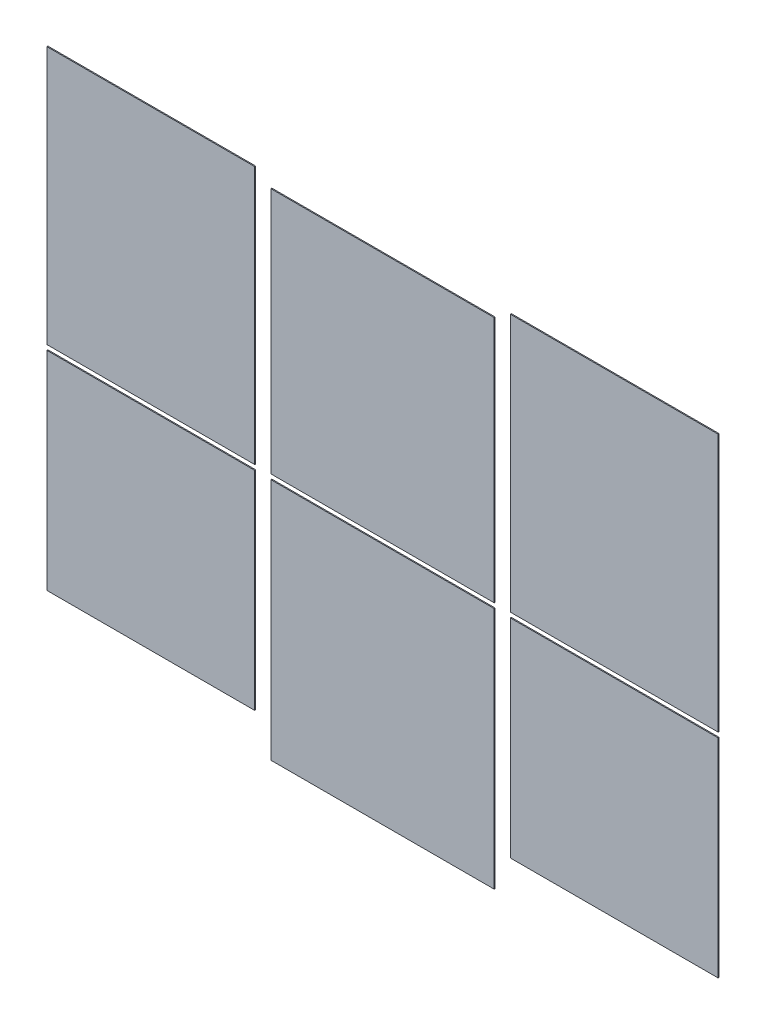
ISO-10303-21;
HEADER;
FILE_DESCRIPTION(('STEP AP214'),'2;1');
FILE_NAME('part.step','',(''),(''),'','','');
FILE_SCHEMA(('AUTOMOTIVE_DESIGN { 1 0 10303 214 1 1 1 1 }'));
ENDSEC;
DATA;
#1=APPLICATION_CONTEXT('core data for automotive mechanical design processes');
#2=APPLICATION_PROTOCOL_DEFINITION('international standard','automotive_design',2000,#1);
#3=PRODUCT_CONTEXT('',#1,'mechanical');
#4=PRODUCT('Part','Part','',(#3));
#5=PRODUCT_RELATED_PRODUCT_CATEGORY('part','',(#4));
#6=PRODUCT_DEFINITION_FORMATION('','',#4);
#7=PRODUCT_DEFINITION_CONTEXT('part definition',#1,'design');
#8=PRODUCT_DEFINITION('design','',#6,#7);
#9=PRODUCT_DEFINITION_SHAPE('','',#8);
#10=(LENGTH_UNIT() NAMED_UNIT(*) SI_UNIT(.MILLI.,.METRE.));
#11=(NAMED_UNIT(*) PLANE_ANGLE_UNIT() SI_UNIT($,.RADIAN.));
#12=(NAMED_UNIT(*) SI_UNIT($,.STERADIAN.) SOLID_ANGLE_UNIT());
#13=UNCERTAINTY_MEASURE_WITH_UNIT(LENGTH_MEASURE(1.E-05),#10,'distance_accuracy_value','');
#14=(GEOMETRIC_REPRESENTATION_CONTEXT(3) GLOBAL_UNCERTAINTY_ASSIGNED_CONTEXT((#13)) GLOBAL_UNIT_ASSIGNED_CONTEXT((#10,
#11,#12)) REPRESENTATION_CONTEXT('',''));
#15=CARTESIAN_POINT('',(0.,0.,0.));
#16=DIRECTION('',(0.,0.,1.));
#17=DIRECTION('',(1.,0.,0.));
#18=AXIS2_PLACEMENT_3D('',#15,#16,#17);
#19=CARTESIAN_POINT('',(-1347.50336801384,10.4351003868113,0.100000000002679));
#20=DIRECTION('',(1.,0.,0.));
#21=DIRECTION('',(0.,0.,-1.));
#22=AXIS2_PLACEMENT_3D('',#19,#20,#21);
#23=PLANE('',#22);
#24=DIRECTION('',(0.,1.,0.));
#25=VECTOR('',#24,1.);
#26=CARTESIAN_POINT('',(-1347.50336801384,10.4351003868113,4.10000000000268));
#27=LINE('',#26,#25);
#28=CARTESIAN_POINT('',(-1347.50336801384,10.4351003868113,4.10000000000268));
#29=VERTEX_POINT('',#28);
#30=CARTESIAN_POINT('',(-1347.50336801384,1040.43510038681,4.10000000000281));
#31=VERTEX_POINT('',#30);
#32=EDGE_CURVE('E114',#29,#31,#27,.T.);
#33=ORIENTED_EDGE('',*,*,#32,.T.);
#34=DIRECTION('',(0.,0.,1.));
#35=VECTOR('',#34,1.);
#36=CARTESIAN_POINT('',(-1347.50336801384,1040.43510038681,0.10000000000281));
#37=LINE('',#36,#35);
#38=CARTESIAN_POINT('',(-1347.50336801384,1040.43510038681,0.10000000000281));
#39=VERTEX_POINT('',#38);
#40=EDGE_CURVE('E12',#39,#31,#37,.T.);
#41=ORIENTED_EDGE('',*,*,#40,.F.);
#42=DIRECTION('',(0.,1.,0.));
#43=VECTOR('',#42,1.);
#44=CARTESIAN_POINT('',(-1347.50336801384,10.4351003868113,0.100000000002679));
#45=LINE('',#44,#43);
#46=CARTESIAN_POINT('',(-1347.50336801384,10.4351003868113,0.100000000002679));
#47=VERTEX_POINT('',#46);
#48=EDGE_CURVE('E101',#47,#39,#45,.T.);
#49=ORIENTED_EDGE('',*,*,#48,.F.);
#50=DIRECTION('',(0.,0.,1.));
#51=VECTOR('',#50,1.);
#52=CARTESIAN_POINT('',(-1347.50336801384,10.4351003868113,0.100000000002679));
#53=LINE('',#52,#51);
#54=EDGE_CURVE('E108',#47,#29,#53,.T.);
#55=ORIENTED_EDGE('',*,*,#54,.T.);
#56=EDGE_LOOP('',(#33,#41,#49,#55));
#57=FACE_BOUND('',#56,.T.);
#58=ADVANCED_FACE('F49',(#57),#23,.F.);
#59=CARTESIAN_POINT('',(-1347.50336801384,1040.43510038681,0.10000000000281));
#60=DIRECTION('',(0.,-1.,0.));
#61=DIRECTION('',(0.,0.,-1.));
#62=AXIS2_PLACEMENT_3D('',#59,#60,#61);
#63=PLANE('',#62);
#64=DIRECTION('',(1.,0.,0.));
#65=VECTOR('',#64,1.);
#66=CARTESIAN_POINT('',(-1347.50336801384,1040.43510038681,4.10000000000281));
#67=LINE('',#66,#65);
#68=CARTESIAN_POINT('',(-517.503368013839,1040.43510038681,4.10000000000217));
#69=VERTEX_POINT('',#68);
#70=EDGE_CURVE('E104',#31,#69,#67,.T.);
#71=ORIENTED_EDGE('',*,*,#70,.T.);
#72=DIRECTION('',(0.,0.,1.));
#73=VECTOR('',#72,1.);
#74=CARTESIAN_POINT('',(-517.503368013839,1040.43510038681,0.100000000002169));
#75=LINE('',#74,#73);
#76=CARTESIAN_POINT('',(-517.503368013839,1040.43510038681,0.100000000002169));
#77=VERTEX_POINT('',#76);
#78=EDGE_CURVE('E59',#77,#69,#75,.T.);
#79=ORIENTED_EDGE('',*,*,#78,.F.);
#80=DIRECTION('',(1.,0.,0.));
#81=VECTOR('',#80,1.);
#82=CARTESIAN_POINT('',(-1347.50336801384,1040.43510038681,0.10000000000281));
#83=LINE('',#82,#81);
#84=EDGE_CURVE('E96',#39,#77,#83,.T.);
#85=ORIENTED_EDGE('',*,*,#84,.F.);
#86=ORIENTED_EDGE('',*,*,#40,.T.);
#87=EDGE_LOOP('',(#71,#79,#85,#86));
#88=FACE_BOUND('',#87,.T.);
#89=ADVANCED_FACE('F102',(#88),#63,.F.);
#90=CARTESIAN_POINT('',(-517.503368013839,10.4351003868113,0.100000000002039));
#91=DIRECTION('',(-1.,0.,0.));
#92=DIRECTION('',(0.,0.,1.));
#93=AXIS2_PLACEMENT_3D('',#90,#91,#92);
#94=PLANE('',#93);
#95=DIRECTION('',(0.,-1.,0.));
#96=VECTOR('',#95,1.);
#97=CARTESIAN_POINT('',(-517.503368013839,10.4351003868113,4.10000000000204));
#98=LINE('',#97,#96);
#99=CARTESIAN_POINT('',(-517.503368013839,10.4351003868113,4.10000000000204));
#100=VERTEX_POINT('',#99);
#101=EDGE_CURVE('E81',#69,#100,#98,.T.);
#102=ORIENTED_EDGE('',*,*,#101,.T.);
#103=DIRECTION('',(0.,0.,1.));
#104=VECTOR('',#103,1.);
#105=CARTESIAN_POINT('',(-517.503368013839,10.4351003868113,0.100000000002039));
#106=LINE('',#105,#104);
#107=CARTESIAN_POINT('',(-517.503368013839,10.4351003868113,0.100000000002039));
#108=VERTEX_POINT('',#107);
#109=EDGE_CURVE('E106',#108,#100,#106,.T.);
#110=ORIENTED_EDGE('',*,*,#109,.F.);
#111=DIRECTION('',(0.,-1.,0.));
#112=VECTOR('',#111,1.);
#113=CARTESIAN_POINT('',(-517.503368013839,10.4351003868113,0.100000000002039));
#114=LINE('',#113,#112);
#115=EDGE_CURVE('E97',#77,#108,#114,.T.);
#116=ORIENTED_EDGE('',*,*,#115,.F.);
#117=ORIENTED_EDGE('',*,*,#78,.T.);
#118=EDGE_LOOP('',(#102,#110,#116,#117));
#119=FACE_BOUND('',#118,.T.);
#120=ADVANCED_FACE('F110',(#119),#94,.F.);
#121=CARTESIAN_POINT('',(-1347.50336801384,10.4351003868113,0.100000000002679));
#122=DIRECTION('',(0.,1.,0.));
#123=DIRECTION('',(0.,0.,1.));
#124=AXIS2_PLACEMENT_3D('',#121,#122,#123);
#125=PLANE('',#124);
#126=DIRECTION('',(-1.,0.,0.));
#127=VECTOR('',#126,1.);
#128=CARTESIAN_POINT('',(-1347.50336801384,10.4351003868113,4.10000000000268));
#129=LINE('',#128,#127);
#130=EDGE_CURVE('E90',#100,#29,#129,.T.);
#131=ORIENTED_EDGE('',*,*,#130,.T.);
#132=ORIENTED_EDGE('',*,*,#54,.F.);
#133=DIRECTION('',(-1.,0.,0.));
#134=VECTOR('',#133,1.);
#135=CARTESIAN_POINT('',(-1347.50336801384,10.4351003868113,0.100000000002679));
#136=LINE('',#135,#134);
#137=EDGE_CURVE('E68',#108,#47,#136,.T.);
#138=ORIENTED_EDGE('',*,*,#137,.F.);
#139=ORIENTED_EDGE('',*,*,#109,.T.);
#140=EDGE_LOOP('',(#131,#132,#138,#139));
#141=FACE_BOUND('',#140,.T.);
#142=ADVANCED_FACE('F118',(#141),#125,.F.);
#143=CARTESIAN_POINT('',(0.,0.,0.100000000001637));
#144=DIRECTION('',(0.,0.,-1.));
#145=DIRECTION('',(-1.,0.,0.));
#146=AXIS2_PLACEMENT_3D('',#143,#144,#145);
#147=PLANE('',#146);
#148=ORIENTED_EDGE('',*,*,#48,.T.);
#149=ORIENTED_EDGE('',*,*,#84,.T.);
#150=ORIENTED_EDGE('',*,*,#115,.T.);
#151=ORIENTED_EDGE('',*,*,#137,.T.);
#152=EDGE_LOOP('',(#148,#149,#150,#151));
#153=FACE_BOUND('',#152,.T.);
#154=ADVANCED_FACE('F100',(#153),#147,.T.);
#155=CARTESIAN_POINT('',(0.,0.,4.10000000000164));
#156=DIRECTION('',(0.,0.,-1.));
#157=DIRECTION('',(-1.,0.,0.));
#158=AXIS2_PLACEMENT_3D('',#155,#156,#157);
#159=PLANE('',#158);
#160=ORIENTED_EDGE('',*,*,#32,.F.);
#161=ORIENTED_EDGE('',*,*,#130,.F.);
#162=ORIENTED_EDGE('',*,*,#101,.F.);
#163=ORIENTED_EDGE('',*,*,#70,.F.);
#164=EDGE_LOOP('',(#160,#161,#162,#163));
#165=FACE_BOUND('',#164,.T.);
#166=ADVANCED_FACE('F121',(#165),#159,.F.);
#167=CLOSED_SHELL('',(#58,#89,#120,#142,#154,#166));
#168=MANIFOLD_SOLID_BREP('B2',#167);
#169=CARTESIAN_POINT('',(-517.503368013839,-839.564899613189,0.100000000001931));
#170=DIRECTION('',(-1.,0.,0.));
#171=DIRECTION('',(0.,0.,1.));
#172=AXIS2_PLACEMENT_3D('',#169,#170,#171);
#173=PLANE('',#172);
#174=DIRECTION('',(0.,-1.,0.));
#175=VECTOR('',#174,1.);
#176=CARTESIAN_POINT('',(-517.503368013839,-839.564899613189,4.10000000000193));
#177=LINE('',#176,#175);
#178=CARTESIAN_POINT('',(-517.503368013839,-9.56489961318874,4.10000000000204));
#179=VERTEX_POINT('',#178);
#180=CARTESIAN_POINT('',(-517.503368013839,-839.564899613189,4.10000000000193));
#181=VERTEX_POINT('',#180);
#182=EDGE_CURVE('E250',#179,#181,#177,.T.);
#183=ORIENTED_EDGE('',*,*,#182,.T.);
#184=DIRECTION('',(0.,0.,1.));
#185=VECTOR('',#184,1.);
#186=CARTESIAN_POINT('',(-517.503368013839,-839.564899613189,0.100000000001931));
#187=LINE('',#186,#185);
#188=CARTESIAN_POINT('',(-517.503368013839,-839.564899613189,0.100000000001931));
#189=VERTEX_POINT('',#188);
#190=EDGE_CURVE('E48',#189,#181,#187,.T.);
#191=ORIENTED_EDGE('',*,*,#190,.F.);
#192=DIRECTION('',(0.,-1.,0.));
#193=VECTOR('',#192,1.);
#194=CARTESIAN_POINT('',(-517.503368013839,-839.564899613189,0.100000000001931));
#195=LINE('',#194,#193);
#196=CARTESIAN_POINT('',(-517.503368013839,-9.56489961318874,0.100000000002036));
#197=VERTEX_POINT('',#196);
#198=EDGE_CURVE('E234',#197,#189,#195,.T.);
#199=ORIENTED_EDGE('',*,*,#198,.F.);
#200=DIRECTION('',(0.,0.,1.));
#201=VECTOR('',#200,1.);
#202=CARTESIAN_POINT('',(-517.503368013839,-9.56489961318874,0.100000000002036));
#203=LINE('',#202,#201);
#204=EDGE_CURVE('E244',#197,#179,#203,.T.);
#205=ORIENTED_EDGE('',*,*,#204,.T.);
#206=EDGE_LOOP('',(#183,#191,#199,#205));
#207=FACE_BOUND('',#206,.T.);
#208=ADVANCED_FACE('F184',(#207),#173,.F.);
#209=CARTESIAN_POINT('',(-517.503368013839,-839.564899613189,0.100000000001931));
#210=DIRECTION('',(0.,1.,0.));
#211=DIRECTION('',(0.,0.,1.));
#212=AXIS2_PLACEMENT_3D('',#209,#210,#211);
#213=PLANE('',#212);
#214=DIRECTION('',(-1.,0.,0.));
#215=VECTOR('',#214,1.);
#216=CARTESIAN_POINT('',(-517.503368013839,-839.564899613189,4.10000000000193));
#217=LINE('',#216,#215);
#218=CARTESIAN_POINT('',(-1347.50336801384,-839.564899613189,4.10000000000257));
#219=VERTEX_POINT('',#218);
#220=EDGE_CURVE('E239',#181,#219,#217,.T.);
#221=ORIENTED_EDGE('',*,*,#220,.T.);
#222=DIRECTION('',(0.,0.,1.));
#223=VECTOR('',#222,1.);
#224=CARTESIAN_POINT('',(-1347.50336801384,-839.564899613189,0.100000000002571));
#225=LINE('',#224,#223);
#226=CARTESIAN_POINT('',(-1347.50336801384,-839.564899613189,0.100000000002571));
#227=VERTEX_POINT('',#226);
#228=EDGE_CURVE('E195',#227,#219,#225,.T.);
#229=ORIENTED_EDGE('',*,*,#228,.F.);
#230=DIRECTION('',(-1.,0.,0.));
#231=VECTOR('',#230,1.);
#232=CARTESIAN_POINT('',(-517.503368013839,-839.564899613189,0.100000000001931));
#233=LINE('',#232,#231);
#234=EDGE_CURVE('E228',#189,#227,#233,.T.);
#235=ORIENTED_EDGE('',*,*,#234,.F.);
#236=ORIENTED_EDGE('',*,*,#190,.T.);
#237=EDGE_LOOP('',(#221,#229,#235,#236));
#238=FACE_BOUND('',#237,.T.);
#239=ADVANCED_FACE('F236',(#238),#213,.F.);
#240=CARTESIAN_POINT('',(-1347.50336801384,-839.564899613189,0.100000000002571));
#241=DIRECTION('',(1.,0.,0.));
#242=DIRECTION('',(0.,0.,-1.));
#243=AXIS2_PLACEMENT_3D('',#240,#241,#242);
#244=PLANE('',#243);
#245=DIRECTION('',(0.,1.,0.));
#246=VECTOR('',#245,1.);
#247=CARTESIAN_POINT('',(-1347.50336801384,-839.564899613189,4.10000000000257));
#248=LINE('',#247,#246);
#249=CARTESIAN_POINT('',(-1347.50336801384,-9.56489961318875,4.10000000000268));
#250=VERTEX_POINT('',#249);
#251=EDGE_CURVE('E220',#219,#250,#248,.T.);
#252=ORIENTED_EDGE('',*,*,#251,.T.);
#253=DIRECTION('',(0.,0.,1.));
#254=VECTOR('',#253,1.);
#255=CARTESIAN_POINT('',(-1347.50336801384,-9.56489961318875,0.100000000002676));
#256=LINE('',#255,#254);
#257=CARTESIAN_POINT('',(-1347.50336801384,-9.56489961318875,0.100000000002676));
#258=VERTEX_POINT('',#257);
#259=EDGE_CURVE('E238',#258,#250,#256,.T.);
#260=ORIENTED_EDGE('',*,*,#259,.F.);
#261=DIRECTION('',(0.,1.,0.));
#262=VECTOR('',#261,1.);
#263=CARTESIAN_POINT('',(-1347.50336801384,-839.564899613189,0.100000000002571));
#264=LINE('',#263,#262);
#265=EDGE_CURVE('E231',#227,#258,#264,.T.);
#266=ORIENTED_EDGE('',*,*,#265,.F.);
#267=ORIENTED_EDGE('',*,*,#228,.T.);
#268=EDGE_LOOP('',(#252,#260,#266,#267));
#269=FACE_BOUND('',#268,.T.);
#270=ADVANCED_FACE('F242',(#269),#244,.F.);
#271=CARTESIAN_POINT('',(-517.503368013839,-9.56489961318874,0.100000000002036));
#272=DIRECTION('',(0.,-1.,0.));
#273=DIRECTION('',(0.,0.,-1.));
#274=AXIS2_PLACEMENT_3D('',#271,#272,#273);
#275=PLANE('',#274);
#276=DIRECTION('',(1.,0.,0.));
#277=VECTOR('',#276,1.);
#278=CARTESIAN_POINT('',(-517.503368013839,-9.56489961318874,4.10000000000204));
#279=LINE('',#278,#277);
#280=EDGE_CURVE('E224',#250,#179,#279,.T.);
#281=ORIENTED_EDGE('',*,*,#280,.T.);
#282=ORIENTED_EDGE('',*,*,#204,.F.);
#283=DIRECTION('',(1.,0.,0.));
#284=VECTOR('',#283,1.);
#285=CARTESIAN_POINT('',(-517.503368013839,-9.56489961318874,0.100000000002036));
#286=LINE('',#285,#284);
#287=EDGE_CURVE('E199',#258,#197,#286,.T.);
#288=ORIENTED_EDGE('',*,*,#287,.F.);
#289=ORIENTED_EDGE('',*,*,#259,.T.);
#290=EDGE_LOOP('',(#281,#282,#288,#289));
#291=FACE_BOUND('',#290,.T.);
#292=ADVANCED_FACE('F255',(#291),#275,.F.);
#293=CARTESIAN_POINT('',(0.,0.,0.100000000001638));
#294=DIRECTION('',(0.,0.,1.));
#295=DIRECTION('',(1.,0.,0.));
#296=AXIS2_PLACEMENT_3D('',#293,#294,#295);
#297=PLANE('',#296);
#298=ORIENTED_EDGE('',*,*,#198,.T.);
#299=ORIENTED_EDGE('',*,*,#234,.T.);
#300=ORIENTED_EDGE('',*,*,#265,.T.);
#301=ORIENTED_EDGE('',*,*,#287,.T.);
#302=EDGE_LOOP('',(#298,#299,#300,#301));
#303=FACE_BOUND('',#302,.T.);
#304=ADVANCED_FACE('F233',(#303),#297,.F.);
#305=CARTESIAN_POINT('',(0.,0.,4.10000000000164));
#306=DIRECTION('',(0.,0.,1.));
#307=DIRECTION('',(1.,0.,0.));
#308=AXIS2_PLACEMENT_3D('',#305,#306,#307);
#309=PLANE('',#308);
#310=ORIENTED_EDGE('',*,*,#182,.F.);
#311=ORIENTED_EDGE('',*,*,#280,.F.);
#312=ORIENTED_EDGE('',*,*,#251,.F.);
#313=ORIENTED_EDGE('',*,*,#220,.F.);
#314=EDGE_LOOP('',(#310,#311,#312,#313));
#315=FACE_BOUND('',#314,.T.);
#316=ADVANCED_FACE('F260',(#315),#309,.T.);
#317=CLOSED_SHELL('',(#208,#239,#270,#292,#304,#316));
#318=MANIFOLD_SOLID_BREP('B6',#317);
#319=CARTESIAN_POINT('',(-453.503368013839,10.4351003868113,0.100000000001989));
#320=DIRECTION('',(1.,0.,0.));
#321=DIRECTION('',(0.,0.,-1.));
#322=AXIS2_PLACEMENT_3D('',#319,#320,#321);
#323=PLANE('',#322);
#324=DIRECTION('',(0.,1.,0.));
#325=VECTOR('',#324,1.);
#326=CARTESIAN_POINT('',(-453.503368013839,10.4351003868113,4.10000000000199));
#327=LINE('',#326,#325);
#328=CARTESIAN_POINT('',(-453.503368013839,10.4351003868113,4.10000000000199));
#329=VERTEX_POINT('',#328);
#330=CARTESIAN_POINT('',(-453.503368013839,996.435100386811,4.10000000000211));
#331=VERTEX_POINT('',#330);
#332=EDGE_CURVE('E381',#329,#331,#327,.T.);
#333=ORIENTED_EDGE('',*,*,#332,.T.);
#334=DIRECTION('',(0.,0.,1.));
#335=VECTOR('',#334,1.);
#336=CARTESIAN_POINT('',(-453.503368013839,996.435100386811,0.100000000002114));
#337=LINE('',#336,#335);
#338=CARTESIAN_POINT('',(-453.503368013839,996.435100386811,0.100000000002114));
#339=VERTEX_POINT('',#338);
#340=EDGE_CURVE('E185',#339,#331,#337,.T.);
#341=ORIENTED_EDGE('',*,*,#340,.F.);
#342=DIRECTION('',(0.,1.,0.));
#343=VECTOR('',#342,1.);
#344=CARTESIAN_POINT('',(-453.503368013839,10.4351003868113,0.100000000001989));
#345=LINE('',#344,#343);
#346=CARTESIAN_POINT('',(-453.503368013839,10.4351003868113,0.100000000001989));
#347=VERTEX_POINT('',#346);
#348=EDGE_CURVE('E369',#347,#339,#345,.T.);
#349=ORIENTED_EDGE('',*,*,#348,.F.);
#350=DIRECTION('',(0.,0.,1.));
#351=VECTOR('',#350,1.);
#352=CARTESIAN_POINT('',(-453.503368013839,10.4351003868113,0.100000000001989));
#353=LINE('',#352,#351);
#354=EDGE_CURVE('E380',#347,#329,#353,.T.);
#355=ORIENTED_EDGE('',*,*,#354,.T.);
#356=EDGE_LOOP('',(#333,#341,#349,#355));
#357=FACE_BOUND('',#356,.T.);
#358=ADVANCED_FACE('F318',(#357),#323,.F.);
#359=CARTESIAN_POINT('',(-453.503368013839,996.435100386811,0.100000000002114));
#360=DIRECTION('',(0.,-1.,0.));
#361=DIRECTION('',(0.,0.,-1.));
#362=AXIS2_PLACEMENT_3D('',#359,#360,#361);
#363=PLANE('',#362);
#364=DIRECTION('',(1.,0.,0.));
#365=VECTOR('',#364,1.);
#366=CARTESIAN_POINT('',(-453.503368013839,996.435100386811,4.10000000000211));
#367=LINE('',#366,#365);
#368=CARTESIAN_POINT('',(438.496631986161,996.435100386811,4.10000000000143));
#369=VERTEX_POINT('',#368);
#370=EDGE_CURVE('E373',#331,#369,#367,.T.);
#371=ORIENTED_EDGE('',*,*,#370,.T.);
#372=DIRECTION('',(0.,0.,1.));
#373=VECTOR('',#372,1.);
#374=CARTESIAN_POINT('',(438.496631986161,996.435100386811,0.100000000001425));
#375=LINE('',#374,#373);
#376=CARTESIAN_POINT('',(438.496631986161,996.435100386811,0.100000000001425));
#377=VERTEX_POINT('',#376);
#378=EDGE_CURVE('E326',#377,#369,#375,.T.);
#379=ORIENTED_EDGE('',*,*,#378,.F.);
#380=DIRECTION('',(1.,0.,0.));
#381=VECTOR('',#380,1.);
#382=CARTESIAN_POINT('',(-453.503368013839,996.435100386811,0.100000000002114));
#383=LINE('',#382,#381);
#384=EDGE_CURVE('E365',#339,#377,#383,.T.);
#385=ORIENTED_EDGE('',*,*,#384,.F.);
#386=ORIENTED_EDGE('',*,*,#340,.T.);
#387=EDGE_LOOP('',(#371,#379,#385,#386));
#388=FACE_BOUND('',#387,.T.);
#389=ADVANCED_FACE('F375',(#388),#363,.F.);
#390=CARTESIAN_POINT('',(438.496631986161,10.4351003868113,0.1000000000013));
#391=DIRECTION('',(-1.,0.,0.));
#392=DIRECTION('',(0.,0.,1.));
#393=AXIS2_PLACEMENT_3D('',#390,#391,#392);
#394=PLANE('',#393);
#395=DIRECTION('',(0.,-1.,0.));
#396=VECTOR('',#395,1.);
#397=CARTESIAN_POINT('',(438.496631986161,10.4351003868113,4.1000000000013));
#398=LINE('',#397,#396);
#399=CARTESIAN_POINT('',(438.496631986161,10.4351003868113,4.1000000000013));
#400=VERTEX_POINT('',#399);
#401=EDGE_CURVE('E352',#369,#400,#398,.T.);
#402=ORIENTED_EDGE('',*,*,#401,.T.);
#403=DIRECTION('',(0.,0.,1.));
#404=VECTOR('',#403,1.);
#405=CARTESIAN_POINT('',(438.496631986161,10.4351003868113,0.1000000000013));
#406=LINE('',#405,#404);
#407=CARTESIAN_POINT('',(438.496631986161,10.4351003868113,0.1000000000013));
#408=VERTEX_POINT('',#407);
#409=EDGE_CURVE('E372',#408,#400,#406,.T.);
#410=ORIENTED_EDGE('',*,*,#409,.F.);
#411=DIRECTION('',(0.,-1.,0.));
#412=VECTOR('',#411,1.);
#413=CARTESIAN_POINT('',(438.496631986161,10.4351003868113,0.1000000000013));
#414=LINE('',#413,#412);
#415=EDGE_CURVE('E370',#377,#408,#414,.T.);
#416=ORIENTED_EDGE('',*,*,#415,.F.);
#417=ORIENTED_EDGE('',*,*,#378,.T.);
#418=EDGE_LOOP('',(#402,#410,#416,#417));
#419=FACE_BOUND('',#418,.T.);
#420=ADVANCED_FACE('F374',(#419),#394,.F.);
#421=CARTESIAN_POINT('',(-453.503368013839,10.4351003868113,0.100000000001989));
#422=DIRECTION('',(0.,1.,0.));
#423=DIRECTION('',(0.,0.,1.));
#424=AXIS2_PLACEMENT_3D('',#421,#422,#423);
#425=PLANE('',#424);
#426=DIRECTION('',(-1.,0.,0.));
#427=VECTOR('',#426,1.);
#428=CARTESIAN_POINT('',(-453.503368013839,10.4351003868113,4.10000000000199));
#429=LINE('',#428,#427);
#430=EDGE_CURVE('E360',#400,#329,#429,.T.);
#431=ORIENTED_EDGE('',*,*,#430,.T.);
#432=ORIENTED_EDGE('',*,*,#354,.F.);
#433=DIRECTION('',(-1.,0.,0.));
#434=VECTOR('',#433,1.);
#435=CARTESIAN_POINT('',(-453.503368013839,10.4351003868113,0.100000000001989));
#436=LINE('',#435,#434);
#437=EDGE_CURVE('E331',#408,#347,#436,.T.);
#438=ORIENTED_EDGE('',*,*,#437,.F.);
#439=ORIENTED_EDGE('',*,*,#409,.T.);
#440=EDGE_LOOP('',(#431,#432,#438,#439));
#441=FACE_BOUND('',#440,.T.);
#442=ADVANCED_FACE('F389',(#441),#425,.F.);
#443=CARTESIAN_POINT('',(0.,0.,0.100000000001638));
#444=DIRECTION('',(0.,0.,-1.));
#445=DIRECTION('',(-1.,0.,0.));
#446=AXIS2_PLACEMENT_3D('',#443,#444,#445);
#447=PLANE('',#446);
#448=ORIENTED_EDGE('',*,*,#348,.T.);
#449=ORIENTED_EDGE('',*,*,#384,.T.);
#450=ORIENTED_EDGE('',*,*,#415,.T.);
#451=ORIENTED_EDGE('',*,*,#437,.T.);
#452=EDGE_LOOP('',(#448,#449,#450,#451));
#453=FACE_BOUND('',#452,.T.);
#454=ADVANCED_FACE('F364',(#453),#447,.T.);
#455=CARTESIAN_POINT('',(0.,0.,4.10000000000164));
#456=DIRECTION('',(0.,0.,-1.));
#457=DIRECTION('',(-1.,0.,0.));
#458=AXIS2_PLACEMENT_3D('',#455,#456,#457);
#459=PLANE('',#458);
#460=ORIENTED_EDGE('',*,*,#332,.F.);
#461=ORIENTED_EDGE('',*,*,#430,.F.);
#462=ORIENTED_EDGE('',*,*,#401,.F.);
#463=ORIENTED_EDGE('',*,*,#370,.F.);
#464=EDGE_LOOP('',(#460,#461,#462,#463));
#465=FACE_BOUND('',#464,.T.);
#466=ADVANCED_FACE('F392',(#465),#459,.F.);
#467=CLOSED_SHELL('',(#358,#389,#420,#442,#454,#466));
#468=MANIFOLD_SOLID_BREP('B45',#467);
#469=CARTESIAN_POINT('',(438.496631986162,-979.564899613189,0.100000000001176));
#470=DIRECTION('',(-1.,0.,0.));
#471=DIRECTION('',(0.,0.,1.));
#472=AXIS2_PLACEMENT_3D('',#469,#470,#471);
#473=PLANE('',#472);
#474=DIRECTION('',(0.,-1.,0.));
#475=VECTOR('',#474,1.);
#476=CARTESIAN_POINT('',(438.496631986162,-979.564899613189,4.10000000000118));
#477=LINE('',#476,#475);
#478=CARTESIAN_POINT('',(438.496631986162,-9.56489961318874,4.1000000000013));
#479=VERTEX_POINT('',#478);
#480=CARTESIAN_POINT('',(438.496631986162,-979.564899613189,4.10000000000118));
#481=VERTEX_POINT('',#480);
#482=EDGE_CURVE('E513',#479,#481,#477,.T.);
#483=ORIENTED_EDGE('',*,*,#482,.T.);
#484=DIRECTION('',(0.,0.,1.));
#485=VECTOR('',#484,1.);
#486=CARTESIAN_POINT('',(438.496631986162,-979.564899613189,0.100000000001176));
#487=LINE('',#486,#485);
#488=CARTESIAN_POINT('',(438.496631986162,-979.564899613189,0.100000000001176));
#489=VERTEX_POINT('',#488);
#490=EDGE_CURVE('E316',#489,#481,#487,.T.);
#491=ORIENTED_EDGE('',*,*,#490,.F.);
#492=DIRECTION('',(0.,-1.,0.));
#493=VECTOR('',#492,1.);
#494=CARTESIAN_POINT('',(438.496631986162,-979.564899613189,0.100000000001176));
#495=LINE('',#494,#493);
#496=CARTESIAN_POINT('',(438.496631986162,-9.56489961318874,0.100000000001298));
#497=VERTEX_POINT('',#496);
#498=EDGE_CURVE('E504',#497,#489,#495,.T.);
#499=ORIENTED_EDGE('',*,*,#498,.F.);
#500=DIRECTION('',(0.,0.,1.));
#501=VECTOR('',#500,1.);
#502=CARTESIAN_POINT('',(438.496631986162,-9.56489961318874,0.100000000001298));
#503=LINE('',#502,#501);
#504=EDGE_CURVE('E512',#497,#479,#503,.T.);
#505=ORIENTED_EDGE('',*,*,#504,.T.);
#506=EDGE_LOOP('',(#483,#491,#499,#505));
#507=FACE_BOUND('',#506,.T.);
#508=ADVANCED_FACE('F455',(#507),#473,.F.);
#509=CARTESIAN_POINT('',(438.496631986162,-979.564899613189,0.100000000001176));
#510=DIRECTION('',(0.,1.,0.));
#511=DIRECTION('',(0.,0.,1.));
#512=AXIS2_PLACEMENT_3D('',#509,#510,#511);
#513=PLANE('',#512);
#514=DIRECTION('',(-1.,0.,0.));
#515=VECTOR('',#514,1.);
#516=CARTESIAN_POINT('',(438.496631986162,-979.564899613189,4.10000000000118));
#517=LINE('',#516,#515);
#518=CARTESIAN_POINT('',(-453.503368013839,-979.564899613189,4.10000000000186));
#519=VERTEX_POINT('',#518);
#520=EDGE_CURVE('E510',#481,#519,#517,.T.);
#521=ORIENTED_EDGE('',*,*,#520,.T.);
#522=DIRECTION('',(0.,0.,1.));
#523=VECTOR('',#522,1.);
#524=CARTESIAN_POINT('',(-453.503368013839,-979.564899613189,0.100000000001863));
#525=LINE('',#524,#523);
#526=CARTESIAN_POINT('',(-453.503368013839,-979.564899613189,0.100000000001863));
#527=VERTEX_POINT('',#526);
#528=EDGE_CURVE('E458',#527,#519,#525,.T.);
#529=ORIENTED_EDGE('',*,*,#528,.F.);
#530=DIRECTION('',(-1.,0.,0.));
#531=VECTOR('',#530,1.);
#532=CARTESIAN_POINT('',(438.496631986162,-979.564899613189,0.100000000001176));
#533=LINE('',#532,#531);
#534=EDGE_CURVE('E499',#489,#527,#533,.T.);
#535=ORIENTED_EDGE('',*,*,#534,.F.);
#536=ORIENTED_EDGE('',*,*,#490,.T.);
#537=EDGE_LOOP('',(#521,#529,#535,#536));
#538=FACE_BOUND('',#537,.T.);
#539=ADVANCED_FACE('F508',(#538),#513,.F.);
#540=CARTESIAN_POINT('',(-453.503368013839,-979.564899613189,0.100000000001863));
#541=DIRECTION('',(1.,0.,0.));
#542=DIRECTION('',(0.,0.,-1.));
#543=AXIS2_PLACEMENT_3D('',#540,#541,#542);
#544=PLANE('',#543);
#545=DIRECTION('',(0.,1.,0.));
#546=VECTOR('',#545,1.);
#547=CARTESIAN_POINT('',(-453.503368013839,-979.564899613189,4.10000000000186));
#548=LINE('',#547,#546);
#549=CARTESIAN_POINT('',(-453.503368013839,-9.56489961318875,4.10000000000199));
#550=VERTEX_POINT('',#549);
#551=EDGE_CURVE('E484',#519,#550,#548,.T.);
#552=ORIENTED_EDGE('',*,*,#551,.T.);
#553=DIRECTION('',(0.,0.,1.));
#554=VECTOR('',#553,1.);
#555=CARTESIAN_POINT('',(-453.503368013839,-9.56489961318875,0.100000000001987));
#556=LINE('',#555,#554);
#557=CARTESIAN_POINT('',(-453.503368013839,-9.56489961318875,0.100000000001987));
#558=VERTEX_POINT('',#557);
#559=EDGE_CURVE('E506',#558,#550,#556,.T.);
#560=ORIENTED_EDGE('',*,*,#559,.F.);
#561=DIRECTION('',(0.,1.,0.));
#562=VECTOR('',#561,1.);
#563=CARTESIAN_POINT('',(-453.503368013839,-979.564899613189,0.100000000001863));
#564=LINE('',#563,#562);
#565=EDGE_CURVE('E502',#527,#558,#564,.T.);
#566=ORIENTED_EDGE('',*,*,#565,.F.);
#567=ORIENTED_EDGE('',*,*,#528,.T.);
#568=EDGE_LOOP('',(#552,#560,#566,#567));
#569=FACE_BOUND('',#568,.T.);
#570=ADVANCED_FACE('F507',(#569),#544,.F.);
#571=CARTESIAN_POINT('',(438.496631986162,-9.56489961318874,0.100000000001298));
#572=DIRECTION('',(0.,-1.,0.));
#573=DIRECTION('',(0.,0.,-1.));
#574=AXIS2_PLACEMENT_3D('',#571,#572,#573);
#575=PLANE('',#574);
#576=DIRECTION('',(1.,0.,0.));
#577=VECTOR('',#576,1.);
#578=CARTESIAN_POINT('',(438.496631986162,-9.56489961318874,4.1000000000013));
#579=LINE('',#578,#577);
#580=EDGE_CURVE('E491',#550,#479,#579,.T.);
#581=ORIENTED_EDGE('',*,*,#580,.T.);
#582=ORIENTED_EDGE('',*,*,#504,.F.);
#583=DIRECTION('',(1.,0.,0.));
#584=VECTOR('',#583,1.);
#585=CARTESIAN_POINT('',(438.496631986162,-9.56489961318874,0.100000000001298));
#586=LINE('',#585,#584);
#587=EDGE_CURVE('E466',#558,#497,#586,.T.);
#588=ORIENTED_EDGE('',*,*,#587,.F.);
#589=ORIENTED_EDGE('',*,*,#559,.T.);
#590=EDGE_LOOP('',(#581,#582,#588,#589));
#591=FACE_BOUND('',#590,.T.);
#592=ADVANCED_FACE('F525',(#591),#575,.F.);
#593=CARTESIAN_POINT('',(0.,0.,0.100000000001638));
#594=DIRECTION('',(0.,0.,1.));
#595=DIRECTION('',(1.,0.,0.));
#596=AXIS2_PLACEMENT_3D('',#593,#594,#595);
#597=PLANE('',#596);
#598=ORIENTED_EDGE('',*,*,#498,.T.);
#599=ORIENTED_EDGE('',*,*,#534,.T.);
#600=ORIENTED_EDGE('',*,*,#565,.T.);
#601=ORIENTED_EDGE('',*,*,#587,.T.);
#602=EDGE_LOOP('',(#598,#599,#600,#601));
#603=FACE_BOUND('',#602,.T.);
#604=ADVANCED_FACE('F496',(#603),#597,.F.);
#605=CARTESIAN_POINT('',(0.,0.,4.10000000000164));
#606=DIRECTION('',(0.,0.,1.));
#607=DIRECTION('',(1.,0.,0.));
#608=AXIS2_PLACEMENT_3D('',#605,#606,#607);
#609=PLANE('',#608);
#610=ORIENTED_EDGE('',*,*,#482,.F.);
#611=ORIENTED_EDGE('',*,*,#580,.F.);
#612=ORIENTED_EDGE('',*,*,#551,.F.);
#613=ORIENTED_EDGE('',*,*,#520,.F.);
#614=EDGE_LOOP('',(#610,#611,#612,#613));
#615=FACE_BOUND('',#614,.T.);
#616=ADVANCED_FACE('F524',(#615),#609,.T.);
#617=CLOSED_SHELL('',(#508,#539,#570,#592,#604,#616));
#618=MANIFOLD_SOLID_BREP('B178',#617);
#619=CARTESIAN_POINT('',(1332.49663198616,-9.56489961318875,0.100000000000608));
#620=DIRECTION('',(-1.,0.,0.));
#621=DIRECTION('',(0.,0.,1.));
#622=AXIS2_PLACEMENT_3D('',#619,#620,#621);
#623=PLANE('',#622);
#624=DIRECTION('',(0.,-1.,0.));
#625=VECTOR('',#624,1.);
#626=CARTESIAN_POINT('',(1332.49663198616,-9.56489961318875,4.10000000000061));
#627=LINE('',#626,#625);
#628=CARTESIAN_POINT('',(1332.49663198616,-9.56489961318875,4.10000000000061));
#629=VERTEX_POINT('',#628);
#630=CARTESIAN_POINT('',(1332.49663198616,-839.564899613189,4.1000000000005));
#631=VERTEX_POINT('',#630);
#632=EDGE_CURVE('E648',#629,#631,#627,.T.);
#633=ORIENTED_EDGE('',*,*,#632,.T.);
#634=DIRECTION('',(0.,0.,1.));
#635=VECTOR('',#634,1.);
#636=CARTESIAN_POINT('',(1332.49663198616,-839.564899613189,0.100000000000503));
#637=LINE('',#636,#635);
#638=CARTESIAN_POINT('',(1332.49663198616,-839.564899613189,0.100000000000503));
#639=VERTEX_POINT('',#638);
#640=EDGE_CURVE('E448',#639,#631,#637,.T.);
#641=ORIENTED_EDGE('',*,*,#640,.F.);
#642=DIRECTION('',(0.,-1.,0.));
#643=VECTOR('',#642,1.);
#644=CARTESIAN_POINT('',(1332.49663198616,-9.56489961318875,0.100000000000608));
#645=LINE('',#644,#643);
#646=CARTESIAN_POINT('',(1332.49663198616,-9.56489961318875,0.100000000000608));
#647=VERTEX_POINT('',#646);
#648=EDGE_CURVE('E638',#647,#639,#645,.T.);
#649=ORIENTED_EDGE('',*,*,#648,.F.);
#650=DIRECTION('',(0.,0.,1.));
#651=VECTOR('',#650,1.);
#652=CARTESIAN_POINT('',(1332.49663198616,-9.56489961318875,0.100000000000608));
#653=LINE('',#652,#651);
#654=EDGE_CURVE('E644',#647,#629,#653,.T.);
#655=ORIENTED_EDGE('',*,*,#654,.T.);
#656=EDGE_LOOP('',(#633,#641,#649,#655));
#657=FACE_BOUND('',#656,.T.);
#658=ADVANCED_FACE('F584',(#657),#623,.F.);
#659=CARTESIAN_POINT('',(1332.49663198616,-839.564899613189,0.100000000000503));
#660=DIRECTION('',(0.,1.,0.));
#661=DIRECTION('',(0.,0.,1.));
#662=AXIS2_PLACEMENT_3D('',#659,#660,#661);
#663=PLANE('',#662);
#664=DIRECTION('',(-1.,0.,0.));
#665=VECTOR('',#664,1.);
#666=CARTESIAN_POINT('',(1332.49663198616,-839.564899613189,4.1000000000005));
#667=LINE('',#666,#665);
#668=CARTESIAN_POINT('',(502.496631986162,-839.564899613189,4.10000000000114));
#669=VERTEX_POINT('',#668);
#670=EDGE_CURVE('E639',#631,#669,#667,.T.);
#671=ORIENTED_EDGE('',*,*,#670,.T.);
#672=DIRECTION('',(0.,0.,1.));
#673=VECTOR('',#672,1.);
#674=CARTESIAN_POINT('',(502.496631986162,-839.564899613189,0.100000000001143));
#675=LINE('',#674,#673);
#676=CARTESIAN_POINT('',(502.496631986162,-839.564899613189,0.100000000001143));
#677=VERTEX_POINT('',#676);
#678=EDGE_CURVE('E593',#677,#669,#675,.T.);
#679=ORIENTED_EDGE('',*,*,#678,.F.);
#680=DIRECTION('',(-1.,0.,0.));
#681=VECTOR('',#680,1.);
#682=CARTESIAN_POINT('',(1332.49663198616,-839.564899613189,0.100000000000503));
#683=LINE('',#682,#681);
#684=EDGE_CURVE('E633',#639,#677,#683,.T.);
#685=ORIENTED_EDGE('',*,*,#684,.F.);
#686=ORIENTED_EDGE('',*,*,#640,.T.);
#687=EDGE_LOOP('',(#671,#679,#685,#686));
#688=FACE_BOUND('',#687,.T.);
#689=ADVANCED_FACE('F640',(#688),#663,.F.);
#690=CARTESIAN_POINT('',(502.496631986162,-9.56489961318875,0.100000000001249));
#691=DIRECTION('',(1.,0.,0.));
#692=DIRECTION('',(0.,0.,-1.));
#693=AXIS2_PLACEMENT_3D('',#690,#691,#692);
#694=PLANE('',#693);
#695=DIRECTION('',(0.,1.,0.));
#696=VECTOR('',#695,1.);
#697=CARTESIAN_POINT('',(502.496631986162,-9.56489961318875,4.10000000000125));
#698=LINE('',#697,#696);
#699=CARTESIAN_POINT('',(502.496631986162,-9.56489961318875,4.10000000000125));
#700=VERTEX_POINT('',#699);
#701=EDGE_CURVE('E616',#669,#700,#698,.T.);
#702=ORIENTED_EDGE('',*,*,#701,.T.);
#703=DIRECTION('',(0.,0.,1.));
#704=VECTOR('',#703,1.);
#705=CARTESIAN_POINT('',(502.496631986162,-9.56489961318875,0.100000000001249));
#706=LINE('',#705,#704);
#707=CARTESIAN_POINT('',(502.496631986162,-9.56489961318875,0.100000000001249));
#708=VERTEX_POINT('',#707);
#709=EDGE_CURVE('E643',#708,#700,#706,.T.);
#710=ORIENTED_EDGE('',*,*,#709,.F.);
#711=DIRECTION('',(0.,1.,0.));
#712=VECTOR('',#711,1.);
#713=CARTESIAN_POINT('',(502.496631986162,-9.56489961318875,0.100000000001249));
#714=LINE('',#713,#712);
#715=EDGE_CURVE('E632',#677,#708,#714,.T.);
#716=ORIENTED_EDGE('',*,*,#715,.F.);
#717=ORIENTED_EDGE('',*,*,#678,.T.);
#718=EDGE_LOOP('',(#702,#710,#716,#717));
#719=FACE_BOUND('',#718,.T.);
#720=ADVANCED_FACE('F645',(#719),#694,.F.);
#721=CARTESIAN_POINT('',(1332.49663198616,-9.56489961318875,0.100000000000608));
#722=DIRECTION('',(0.,-1.,0.));
#723=DIRECTION('',(0.,0.,-1.));
#724=AXIS2_PLACEMENT_3D('',#721,#722,#723);
#725=PLANE('',#724);
#726=DIRECTION('',(1.,0.,0.));
#727=VECTOR('',#726,1.);
#728=CARTESIAN_POINT('',(1332.49663198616,-9.56489961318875,4.10000000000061));
#729=LINE('',#728,#727);
#730=EDGE_CURVE('E624',#700,#629,#729,.T.);
#731=ORIENTED_EDGE('',*,*,#730,.T.);
#732=ORIENTED_EDGE('',*,*,#654,.F.);
#733=DIRECTION('',(1.,0.,0.));
#734=VECTOR('',#733,1.);
#735=CARTESIAN_POINT('',(1332.49663198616,-9.56489961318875,0.100000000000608));
#736=LINE('',#735,#734);
#737=EDGE_CURVE('E601',#708,#647,#736,.T.);
#738=ORIENTED_EDGE('',*,*,#737,.F.);
#739=ORIENTED_EDGE('',*,*,#709,.T.);
#740=EDGE_LOOP('',(#731,#732,#738,#739));
#741=FACE_BOUND('',#740,.T.);
#742=ADVANCED_FACE('F654',(#741),#725,.F.);
#743=CARTESIAN_POINT('',(0.,0.,0.100000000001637));
#744=DIRECTION('',(0.,0.,-1.));
#745=DIRECTION('',(-1.,0.,0.));
#746=AXIS2_PLACEMENT_3D('',#743,#744,#745);
#747=PLANE('',#746);
#748=ORIENTED_EDGE('',*,*,#648,.T.);
#749=ORIENTED_EDGE('',*,*,#684,.T.);
#750=ORIENTED_EDGE('',*,*,#715,.T.);
#751=ORIENTED_EDGE('',*,*,#737,.T.);
#752=EDGE_LOOP('',(#748,#749,#750,#751));
#753=FACE_BOUND('',#752,.T.);
#754=ADVANCED_FACE('F635',(#753),#747,.T.);
#755=CARTESIAN_POINT('',(0.,0.,4.10000000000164));
#756=DIRECTION('',(0.,0.,-1.));
#757=DIRECTION('',(-1.,0.,0.));
#758=AXIS2_PLACEMENT_3D('',#755,#756,#757);
#759=PLANE('',#758);
#760=ORIENTED_EDGE('',*,*,#632,.F.);
#761=ORIENTED_EDGE('',*,*,#730,.F.);
#762=ORIENTED_EDGE('',*,*,#701,.F.);
#763=ORIENTED_EDGE('',*,*,#670,.F.);
#764=EDGE_LOOP('',(#760,#761,#762,#763));
#765=FACE_BOUND('',#764,.T.);
#766=ADVANCED_FACE('F657',(#765),#759,.F.);
#767=CLOSED_SHELL('',(#658,#689,#720,#742,#754,#766));
#768=MANIFOLD_SOLID_BREP('B309',#767);
#769=CARTESIAN_POINT('',(1332.49663198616,1040.43510038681,0.100000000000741));
#770=DIRECTION('',(-1.,0.,0.));
#771=DIRECTION('',(0.,0.,1.));
#772=AXIS2_PLACEMENT_3D('',#769,#770,#771);
#773=PLANE('',#772);
#774=DIRECTION('',(0.,-1.,0.));
#775=VECTOR('',#774,1.);
#776=CARTESIAN_POINT('',(1332.49663198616,1040.43510038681,4.10000000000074));
#777=LINE('',#776,#775);
#778=CARTESIAN_POINT('',(1332.49663198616,1040.43510038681,4.10000000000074));
#779=VERTEX_POINT('',#778);
#780=CARTESIAN_POINT('',(1332.49663198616,10.4351003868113,4.10000000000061));
#781=VERTEX_POINT('',#780);
#782=EDGE_CURVE('E775',#779,#781,#777,.T.);
#783=ORIENTED_EDGE('',*,*,#782,.T.);
#784=DIRECTION('',(0.,0.,1.));
#785=VECTOR('',#784,1.);
#786=CARTESIAN_POINT('',(1332.49663198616,10.4351003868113,0.100000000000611));
#787=LINE('',#786,#785);
#788=CARTESIAN_POINT('',(1332.49663198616,10.4351003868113,0.100000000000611));
#789=VERTEX_POINT('',#788);
#790=EDGE_CURVE('E581',#789,#781,#787,.T.);
#791=ORIENTED_EDGE('',*,*,#790,.F.);
#792=DIRECTION('',(0.,-1.,0.));
#793=VECTOR('',#792,1.);
#794=CARTESIAN_POINT('',(1332.49663198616,1040.43510038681,0.100000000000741));
#795=LINE('',#794,#793);
#796=CARTESIAN_POINT('',(1332.49663198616,1040.43510038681,0.100000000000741));
#797=VERTEX_POINT('',#796);
#798=EDGE_CURVE('E759',#797,#789,#795,.T.);
#799=ORIENTED_EDGE('',*,*,#798,.F.);
#800=DIRECTION('',(0.,0.,1.));
#801=VECTOR('',#800,1.);
#802=CARTESIAN_POINT('',(1332.49663198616,1040.43510038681,0.100000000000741));
#803=LINE('',#802,#801);
#804=EDGE_CURVE('E767',#797,#779,#803,.T.);
#805=ORIENTED_EDGE('',*,*,#804,.T.);
#806=EDGE_LOOP('',(#783,#791,#799,#805));
#807=FACE_BOUND('',#806,.T.);
#808=ADVANCED_FACE('F707',(#807),#773,.F.);
#809=CARTESIAN_POINT('',(1332.49663198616,10.4351003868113,0.100000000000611));
#810=DIRECTION('',(0.,1.,0.));
#811=DIRECTION('',(0.,0.,1.));
#812=AXIS2_PLACEMENT_3D('',#809,#810,#811);
#813=PLANE('',#812);
#814=DIRECTION('',(-1.,0.,0.));
#815=VECTOR('',#814,1.);
#816=CARTESIAN_POINT('',(1332.49663198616,10.4351003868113,4.10000000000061));
#817=LINE('',#816,#815);
#818=CARTESIAN_POINT('',(502.496631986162,10.4351003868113,4.10000000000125));
#819=VERTEX_POINT('',#818);
#820=EDGE_CURVE('E762',#781,#819,#817,.T.);
#821=ORIENTED_EDGE('',*,*,#820,.T.);
#822=DIRECTION('',(0.,0.,1.));
#823=VECTOR('',#822,1.);
#824=CARTESIAN_POINT('',(502.496631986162,10.4351003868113,0.100000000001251));
#825=LINE('',#824,#823);
#826=CARTESIAN_POINT('',(502.496631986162,10.4351003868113,0.100000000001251));
#827=VERTEX_POINT('',#826);
#828=EDGE_CURVE('E720',#827,#819,#825,.T.);
#829=ORIENTED_EDGE('',*,*,#828,.F.);
#830=DIRECTION('',(-1.,0.,0.));
#831=VECTOR('',#830,1.);
#832=CARTESIAN_POINT('',(1332.49663198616,10.4351003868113,0.100000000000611));
#833=LINE('',#832,#831);
#834=EDGE_CURVE('E752',#789,#827,#833,.T.);
#835=ORIENTED_EDGE('',*,*,#834,.F.);
#836=ORIENTED_EDGE('',*,*,#790,.T.);
#837=EDGE_LOOP('',(#821,#829,#835,#836));
#838=FACE_BOUND('',#837,.T.);
#839=ADVANCED_FACE('F763',(#838),#813,.F.);
#840=CARTESIAN_POINT('',(502.496631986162,1040.43510038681,0.100000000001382));
#841=DIRECTION('',(1.,0.,0.));
#842=DIRECTION('',(0.,0.,-1.));
#843=AXIS2_PLACEMENT_3D('',#840,#841,#842);
#844=PLANE('',#843);
#845=DIRECTION('',(0.,1.,0.));
#846=VECTOR('',#845,1.);
#847=CARTESIAN_POINT('',(502.496631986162,1040.43510038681,4.10000000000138));
#848=LINE('',#847,#846);
#849=CARTESIAN_POINT('',(502.496631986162,1040.43510038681,4.10000000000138));
#850=VERTEX_POINT('',#849);
#851=EDGE_CURVE('E745',#819,#850,#848,.T.);
#852=ORIENTED_EDGE('',*,*,#851,.T.);
#853=DIRECTION('',(0.,0.,1.));
#854=VECTOR('',#853,1.);
#855=CARTESIAN_POINT('',(502.496631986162,1040.43510038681,0.100000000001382));
#856=LINE('',#855,#854);
#857=CARTESIAN_POINT('',(502.496631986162,1040.43510038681,0.100000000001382));
#858=VERTEX_POINT('',#857);
#859=EDGE_CURVE('E764',#858,#850,#856,.T.);
#860=ORIENTED_EDGE('',*,*,#859,.F.);
#861=DIRECTION('',(0.,1.,0.));
#862=VECTOR('',#861,1.);
#863=CARTESIAN_POINT('',(502.496631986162,1040.43510038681,0.100000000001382));
#864=LINE('',#863,#862);
#865=EDGE_CURVE('E758',#827,#858,#864,.T.);
#866=ORIENTED_EDGE('',*,*,#865,.F.);
#867=ORIENTED_EDGE('',*,*,#828,.T.);
#868=EDGE_LOOP('',(#852,#860,#866,#867));
#869=FACE_BOUND('',#868,.T.);
#870=ADVANCED_FACE('F766',(#869),#844,.F.);
#871=CARTESIAN_POINT('',(1332.49663198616,1040.43510038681,0.100000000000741));
#872=DIRECTION('',(0.,-1.,0.));
#873=DIRECTION('',(0.,0.,-1.));
#874=AXIS2_PLACEMENT_3D('',#871,#872,#873);
#875=PLANE('',#874);
#876=DIRECTION('',(1.,0.,0.));
#877=VECTOR('',#876,1.);
#878=CARTESIAN_POINT('',(1332.49663198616,1040.43510038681,4.10000000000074));
#879=LINE('',#878,#877);
#880=EDGE_CURVE('E746',#850,#779,#879,.T.);
#881=ORIENTED_EDGE('',*,*,#880,.T.);
#882=ORIENTED_EDGE('',*,*,#804,.F.);
#883=DIRECTION('',(1.,0.,0.));
#884=VECTOR('',#883,1.);
#885=CARTESIAN_POINT('',(1332.49663198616,1040.43510038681,0.100000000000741));
#886=LINE('',#885,#884);
#887=EDGE_CURVE('E723',#858,#797,#886,.T.);
#888=ORIENTED_EDGE('',*,*,#887,.F.);
#889=ORIENTED_EDGE('',*,*,#859,.T.);
#890=EDGE_LOOP('',(#881,#882,#888,#889));
#891=FACE_BOUND('',#890,.T.);
#892=ADVANCED_FACE('F776',(#891),#875,.F.);
#893=CARTESIAN_POINT('',(0.,0.,0.100000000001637));
#894=DIRECTION('',(0.,0.,-1.));
#895=DIRECTION('',(-1.,0.,0.));
#896=AXIS2_PLACEMENT_3D('',#893,#894,#895);
#897=PLANE('',#896);
#898=ORIENTED_EDGE('',*,*,#798,.T.);
#899=ORIENTED_EDGE('',*,*,#834,.T.);
#900=ORIENTED_EDGE('',*,*,#865,.T.);
#901=ORIENTED_EDGE('',*,*,#887,.T.);
#902=EDGE_LOOP('',(#898,#899,#900,#901));
#903=FACE_BOUND('',#902,.T.);
#904=ADVANCED_FACE('F756',(#903),#897,.T.);
#905=CARTESIAN_POINT('',(0.,0.,4.10000000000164));
#906=DIRECTION('',(0.,0.,-1.));
#907=DIRECTION('',(-1.,0.,0.));
#908=AXIS2_PLACEMENT_3D('',#905,#906,#907);
#909=PLANE('',#908);
#910=ORIENTED_EDGE('',*,*,#782,.F.);
#911=ORIENTED_EDGE('',*,*,#880,.F.);
#912=ORIENTED_EDGE('',*,*,#851,.F.);
#913=ORIENTED_EDGE('',*,*,#820,.F.);
#914=EDGE_LOOP('',(#910,#911,#912,#913));
#915=FACE_BOUND('',#914,.T.);
#916=ADVANCED_FACE('F785',(#915),#909,.F.);
#917=CLOSED_SHELL('',(#808,#839,#870,#892,#904,#916));
#918=MANIFOLD_SOLID_BREP('B441',#917);
#919=ADVANCED_BREP_SHAPE_REPRESENTATION('',(#18,#168,#318,#468,#618,#768,#918),#14);
#920=SHAPE_DEFINITION_REPRESENTATION(#9,#919);
ENDSEC;
END-ISO-10303-21;
